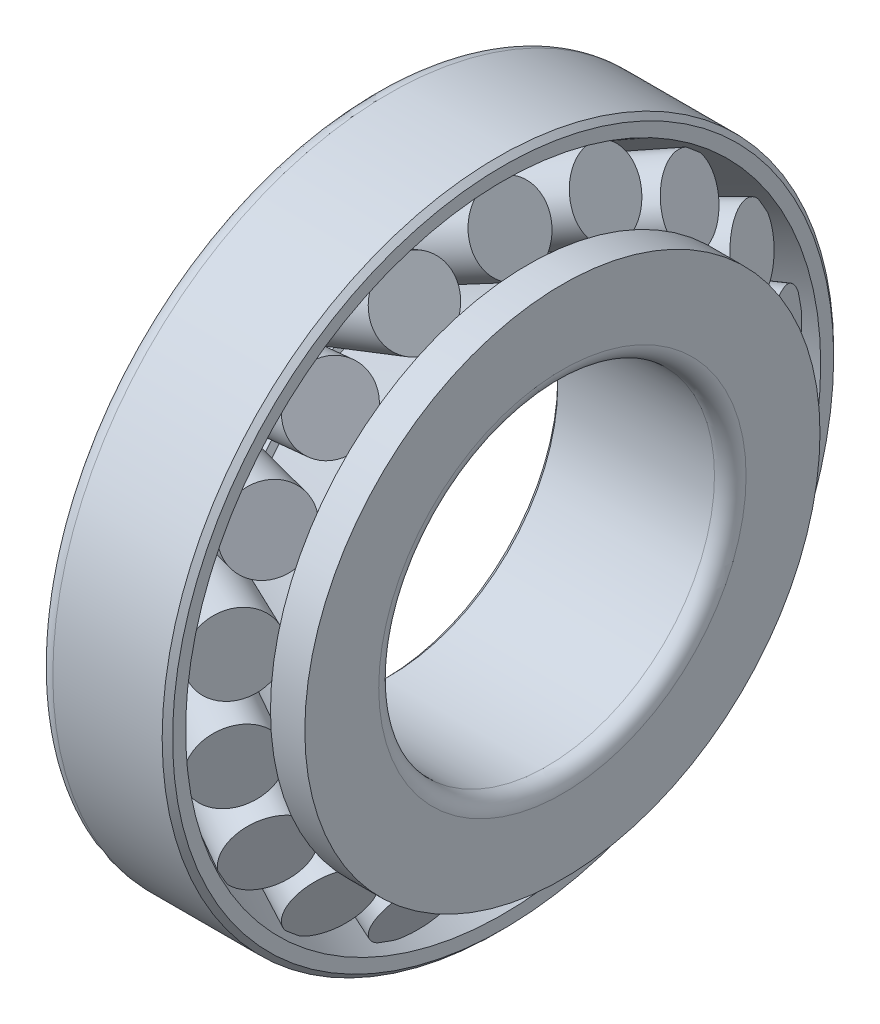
from build123d import *

# Parameters (mm, degrees)
ROLLERSDETAILED_COUNT = 18
ROLLERSDETAILED_ANGLE = 340


with BuildPart() as part:
    # OutRacSke → OuterRace (revolve)
    with BuildSketch(Plane.XY, mode=Mode.PRIVATE) as outerrace_sk:
        with BuildLine():
            Line((-15, 80.389973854), (-48, 62.814))
            Line((-48, 62.814), (-48, 81))
            ThreePointArc((-48, 81), (-46.828427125, 83.828427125), (-44, 85))
            Line((-44, 85), (-16.32, 85))
            Line((-16.32, 85), (-15, 83.68))
            Line((-15, 83.68), (-15, 80.389973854))
        make_face()
    outerrace = revolve(outerrace_sk.sketch.rotate(Axis((-42.5, 0, 0), (1, 0, 0)), 270), axis=Axis((-42.5, 0, 0), (1, 0, 0)))

    # RolDetSke → RollerDetailed (revolve)
    with BuildSketch(Plane.XY):
        Polygon((-39.475404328, 56.773929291), (-44, 65.269143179), (-17.786197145, 79.230752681), (-13.261601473, 70.735538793), align=None)
    rollerdetailed = revolve(axis=Axis((-49.062875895, 51.667591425, 0), (0.8826196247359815, 0.4700878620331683, 0)))

    # RollersDetailed: OuterRace, RollerDetailed ×18 about axis
    rollersdetailed_axis = Axis((-50, 0, 0), (1, 0, 0))
    add([outerrace.rotate(rollersdetailed_axis, i * ROLLERSDETAILED_ANGLE / (ROLLERSDETAILED_COUNT - 1)) for i in range(1, ROLLERSDETAILED_COUNT)])
    add([rollerdetailed.rotate(rollersdetailed_axis, i * ROLLERSDETAILED_ANGLE / (ROLLERSDETAILED_COUNT - 1)) for i in range(1, ROLLERSDETAILED_COUNT)])

    # InsRacSke → InnerRace (revolve)
    with BuildSketch(Plane.XY, mode=Mode.PRIVATE) as innerrace_sk:
        with BuildLine():
            Line((-35.696481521, 49.763715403), (-45, 49.763715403))
            Line((-45, 49.763715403), (-45, 43.82))
            Line((-45, 43.82), (-43.68, 42.5))
            Line((-43.68, 42.5), (-4, 42.5))
            ThreePointArc((-4, 42.5), (-1.171572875, 43.671572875), (0, 46.5))
            Line((0, 46.5), (0, 65.210324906))
            Line((0, 65.210324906), (-8.691759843, 65.210324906))
            Line((-8.691759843, 65.210324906), (-8.691759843, 62.240324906))
            Line((-8.691759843, 62.240324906), (-34.905562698, 48.278715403))
            Line((-34.905562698, 48.278715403), (-35.696481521, 49.763715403))
        make_face()
    revolve(innerrace_sk.sketch.rotate(Axis((-42.5, 0, 0), (1, 0, 0)), 270), axis=Axis((-42.5, 0, 0), (1, 0, 0)))


solid = part.part
